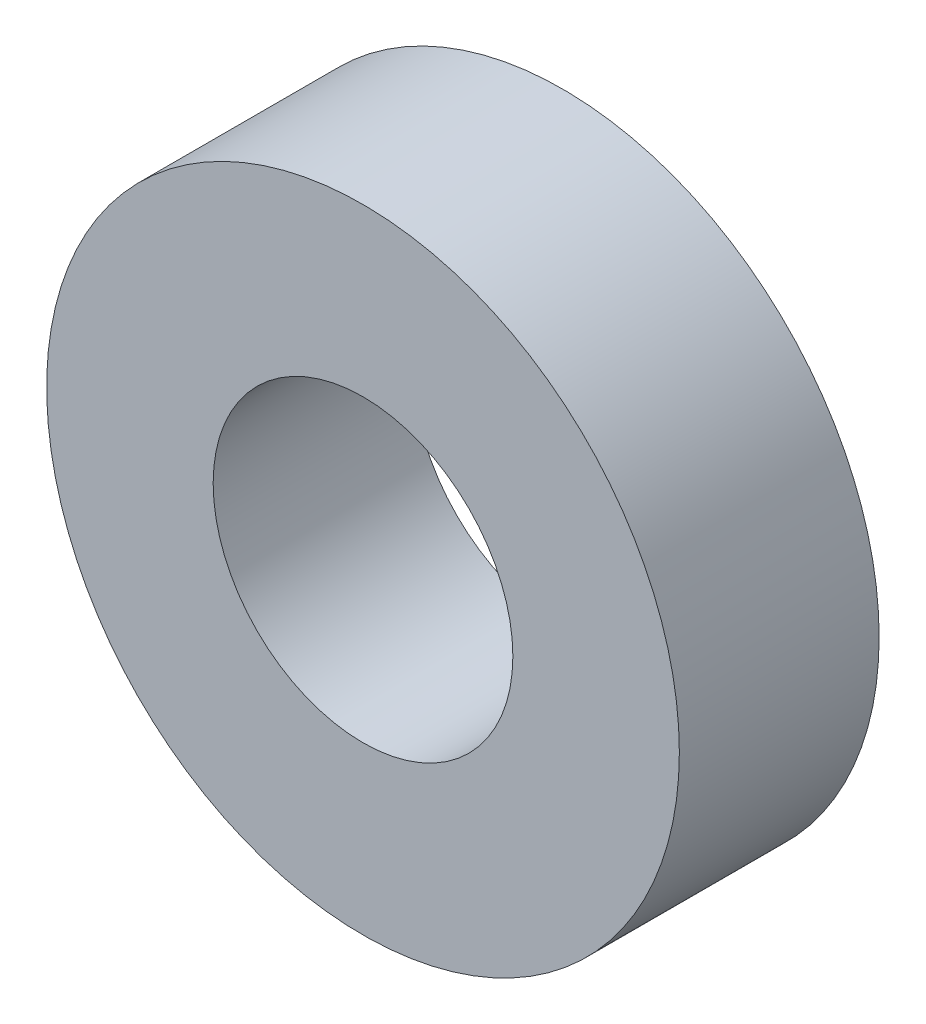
ISO-10303-21;
HEADER;
FILE_DESCRIPTION(('STEP AP214'),'2;1');
FILE_NAME('part.step','',(''),(''),'','','');
FILE_SCHEMA(('AUTOMOTIVE_DESIGN { 1 0 10303 214 1 1 1 1 }'));
ENDSEC;
DATA;
#1=APPLICATION_CONTEXT('core data for automotive mechanical design processes');
#2=APPLICATION_PROTOCOL_DEFINITION('international standard','automotive_design',2000,#1);
#3=PRODUCT_CONTEXT('',#1,'mechanical');
#4=PRODUCT('Part','Part','',(#3));
#5=PRODUCT_RELATED_PRODUCT_CATEGORY('part','',(#4));
#6=PRODUCT_DEFINITION_FORMATION('','',#4);
#7=PRODUCT_DEFINITION_CONTEXT('part definition',#1,'design');
#8=PRODUCT_DEFINITION('design','',#6,#7);
#9=PRODUCT_DEFINITION_SHAPE('','',#8);
#10=(LENGTH_UNIT() NAMED_UNIT(*) SI_UNIT(.MILLI.,.METRE.));
#11=(NAMED_UNIT(*) PLANE_ANGLE_UNIT() SI_UNIT($,.RADIAN.));
#12=(NAMED_UNIT(*) SI_UNIT($,.STERADIAN.) SOLID_ANGLE_UNIT());
#13=UNCERTAINTY_MEASURE_WITH_UNIT(LENGTH_MEASURE(1.E-05),#10,'distance_accuracy_value','');
#14=(GEOMETRIC_REPRESENTATION_CONTEXT(3) GLOBAL_UNCERTAINTY_ASSIGNED_CONTEXT((#13)) GLOBAL_UNIT_ASSIGNED_CONTEXT((#10,
#11,#12)) REPRESENTATION_CONTEXT('',''));
#15=CARTESIAN_POINT('',(0.,0.,0.));
#16=DIRECTION('',(0.,0.,1.));
#17=DIRECTION('',(1.,0.,0.));
#18=AXIS2_PLACEMENT_3D('',#15,#16,#17);
#19=CARTESIAN_POINT('',(0.,0.,3.6));
#20=DIRECTION('',(0.,0.,1.));
#21=DIRECTION('',(1.,0.,0.));
#22=AXIS2_PLACEMENT_3D('',#19,#20,#21);
#23=PLANE('',#22);
#24=CARTESIAN_POINT('',(0.,0.,3.6));
#25=DIRECTION('',(0.,0.,1.));
#26=DIRECTION('',(1.,0.,0.));
#27=AXIS2_PLACEMENT_3D('',#24,#25,#26);
#28=CIRCLE('',#27,5.7);
#29=CARTESIAN_POINT('',(5.7,0.,3.6));
#30=VERTEX_POINT('',#29);
#31=EDGE_CURVE('E10',#30,#30,#28,.T.);
#32=ORIENTED_EDGE('',*,*,#31,.T.);
#33=EDGE_LOOP('',(#32));
#34=FACE_BOUND('',#33,.T.);
#35=CARTESIAN_POINT('',(0.,0.,3.6));
#36=DIRECTION('',(0.,0.,1.));
#37=DIRECTION('',(1.,0.,0.));
#38=AXIS2_PLACEMENT_3D('',#35,#36,#37);
#39=CIRCLE('',#38,2.7);
#40=CARTESIAN_POINT('',(2.7,0.,3.6));
#41=VERTEX_POINT('',#40);
#42=EDGE_CURVE('E42',#41,#41,#39,.T.);
#43=ORIENTED_EDGE('',*,*,#42,.F.);
#44=EDGE_LOOP('',(#43));
#45=FACE_BOUND('',#44,.T.);
#46=ADVANCED_FACE('F31',(#34,#45),#23,.T.);
#47=CARTESIAN_POINT('',(0.,0.,0.));
#48=DIRECTION('',(0.,0.,1.));
#49=DIRECTION('',(1.,0.,0.));
#50=AXIS2_PLACEMENT_3D('',#47,#48,#49);
#51=PLANE('',#50);
#52=CARTESIAN_POINT('',(0.,0.,0.));
#53=DIRECTION('',(0.,0.,1.));
#54=DIRECTION('',(1.,0.,0.));
#55=AXIS2_PLACEMENT_3D('',#52,#53,#54);
#56=CIRCLE('',#55,5.7);
#57=CARTESIAN_POINT('',(5.7,0.,0.));
#58=VERTEX_POINT('',#57);
#59=EDGE_CURVE('E35',#58,#58,#56,.T.);
#60=ORIENTED_EDGE('',*,*,#59,.F.);
#61=EDGE_LOOP('',(#60));
#62=FACE_BOUND('',#61,.T.);
#63=CARTESIAN_POINT('',(0.,0.,0.));
#64=DIRECTION('',(0.,0.,1.));
#65=DIRECTION('',(1.,0.,0.));
#66=AXIS2_PLACEMENT_3D('',#63,#64,#65);
#67=CIRCLE('',#66,2.7);
#68=CARTESIAN_POINT('',(2.7,0.,0.));
#69=VERTEX_POINT('',#68);
#70=EDGE_CURVE('E44',#69,#69,#67,.T.);
#71=ORIENTED_EDGE('',*,*,#70,.T.);
#72=EDGE_LOOP('',(#71));
#73=FACE_BOUND('',#72,.T.);
#74=ADVANCED_FACE('F54',(#62,#73),#51,.F.);
#75=CARTESIAN_POINT('',(0.,0.,3.6));
#76=DIRECTION('',(0.,0.,-1.));
#77=DIRECTION('',(-1.,0.,0.));
#78=AXIS2_PLACEMENT_3D('',#75,#76,#77);
#79=CYLINDRICAL_SURFACE('',#78,5.7);
#80=ORIENTED_EDGE('',*,*,#31,.F.);
#81=EDGE_LOOP('',(#80));
#82=FACE_BOUND('',#81,.T.);
#83=ORIENTED_EDGE('',*,*,#59,.T.);
#84=EDGE_LOOP('',(#83));
#85=FACE_BOUND('',#84,.T.);
#86=ADVANCED_FACE('F33',(#82,#85),#79,.T.);
#87=CARTESIAN_POINT('',(0.,0.,3.6));
#88=DIRECTION('',(0.,0.,-1.));
#89=DIRECTION('',(-1.,0.,0.));
#90=AXIS2_PLACEMENT_3D('',#87,#88,#89);
#91=CYLINDRICAL_SURFACE('',#90,2.7);
#92=ORIENTED_EDGE('',*,*,#42,.T.);
#93=EDGE_LOOP('',(#92));
#94=FACE_BOUND('',#93,.T.);
#95=ORIENTED_EDGE('',*,*,#70,.F.);
#96=EDGE_LOOP('',(#95));
#97=FACE_BOUND('',#96,.T.);
#98=ADVANCED_FACE('F50',(#94,#97),#91,.F.);
#99=CLOSED_SHELL('',(#46,#74,#86,#98));
#100=MANIFOLD_SOLID_BREP('B2',#99);
#101=ADVANCED_BREP_SHAPE_REPRESENTATION('',(#18,#100),#14);
#102=SHAPE_DEFINITION_REPRESENTATION(#9,#101);
ENDSEC;
END-ISO-10303-21;
